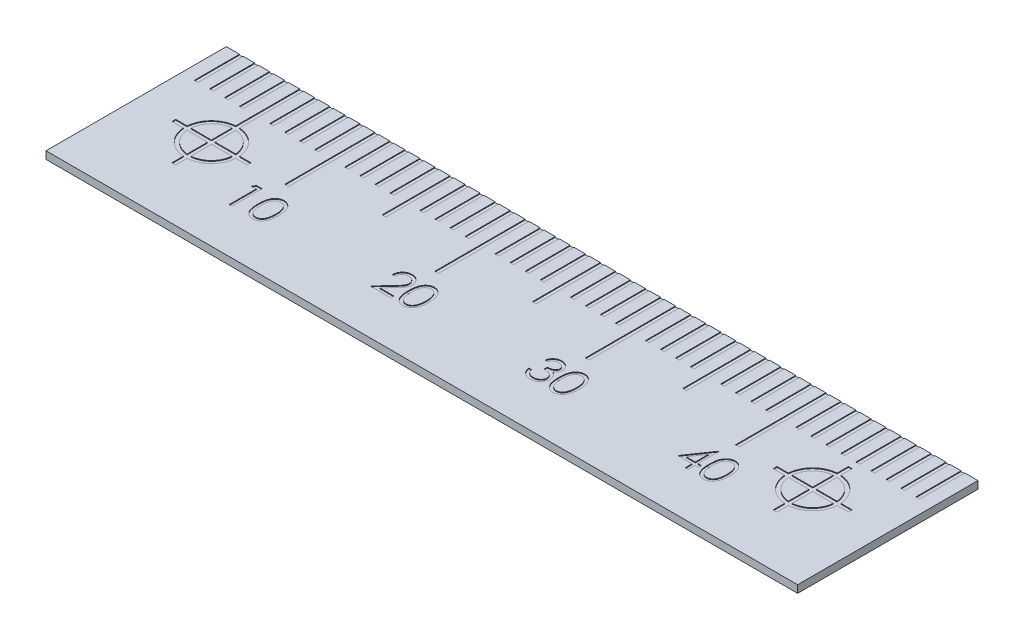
from build123d import *

# Parameters (mm, degrees)
SKETCH1_W           = 50
SKETCH1_H           = 12
BOSS_EXTRUDE1_DEPTH = 0.5
SKETCH2_W           = 0.25
SKETCH2_H           = 3
CUT_EXTRUDE2_DEPTH  = 0.05
LPATTERN2_COUNT     = 49
LPATTERN2_PITCH     = 1
SKETCH3_W           = 0.25
SKETCH3_H           = 3
CUT_EXTRUDE3_DEPTH  = 0.05
LPATTERN3_COUNT     = 4
LPATTERN3_PITCH     = 10
SKETCH4_W           = 0.25
SKETCH4_H           = 1.5
CUT_EXTRUDE4_DEPTH  = 0.05
LPATTERN4_COUNT     = 3
LPATTERN4_PITCH     = 10
LPATTERN4_COL_COUNT = 2
LPATTERN4_COL_PITCH = 10
CUT_EXTRUDE6_DEPTH  = 0.05
LPATTERN5_COUNT     = 2
LPATTERN5_PITCH     = 40
CUT_EXTRUDE7_DEPTH  = 0.05


with BuildPart() as part:
    # Sketch1 → Boss-Extrude1 (new body)
    with BuildSketch(Plane(origin=(0, 0, 0), x_dir=(1, 0, 0), z_dir=(0, 1, 0))):
        Rectangle(SKETCH1_W, SKETCH1_H)
    extrude(amount=-BOSS_EXTRUDE1_DEPTH)

    # Sketch2 → Cut-Extrude2 (cut)
    with BuildSketch(Plane(origin=(0, 0, 0), x_dir=(1, 0, 0), z_dir=(0, 1, 0))):
        with Locations((-24, 4.5)):
            Rectangle(SKETCH2_W, SKETCH2_H)
    cut_extrude2 = extrude(amount=-CUT_EXTRUDE2_DEPTH, mode=Mode.SUBTRACT)

    # LPattern2: Cut-Extrude2 ×49
    with Locations(*[(i * LPATTERN2_PITCH, 0, 0) for i in range(1, LPATTERN2_COUNT)]):
        add(cut_extrude2, mode=Mode.SUBTRACT)

    # Sketch3 → Cut-Extrude3 (cut)
    with BuildSketch(Plane(origin=(0, 0, 0), x_dir=(1, 0, 0), z_dir=(0, 1, 0))):
        with Locations((-15, 1.5)):
            Rectangle(SKETCH3_W, SKETCH3_H)
    cut_extrude3 = extrude(amount=-CUT_EXTRUDE3_DEPTH, mode=Mode.SUBTRACT)

    # LPattern3: Cut-Extrude3 ×4
    with Locations(*[(i * LPATTERN3_PITCH, 0, 0) for i in range(1, LPATTERN3_COUNT)]):
        add(cut_extrude3, mode=Mode.SUBTRACT)

    # Sketch4 → Cut-Extrude4 (cut)
    with BuildSketch(Plane(origin=(0, 0, 0), x_dir=(1, 0, 0), z_dir=(0, 1, 0))):
        with Locations((-10, 2.25)):
            Rectangle(SKETCH4_W, SKETCH4_H)
    cut_extrude4 = extrude(amount=-CUT_EXTRUDE4_DEPTH, mode=Mode.SUBTRACT)

    # LPattern4: Cut-Extrude4 ×3
    with Locations(*[(i * LPATTERN4_PITCH, 0, 0) for i in range(1, LPATTERN4_COUNT)]):
        add(cut_extrude4, mode=Mode.SUBTRACT)

    # LPattern4 col: Cut-Extrude4 ×2
    with Locations(*[(-i * LPATTERN4_COL_PITCH, 0, 0) for i in range(1, LPATTERN4_COL_COUNT)]):
        add(cut_extrude4, mode=Mode.SUBTRACT)

    # Sketch5 → Cut-Extrude6 (cut)
    with BuildSketch(Plane(origin=(0, 0, 0), x_dir=(1, 0, 0), z_dir=(0, 1, 0))):
        with BuildLine():
            Line((-20.12, 2.5), (-19.87, 2.5))
            Line((-19.87, 2.5), (-19.87, 1.745530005))
            ThreePointArc((-19.87, 1.745530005), (-18.757563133, 1.237436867), (-18.249469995, 0.125))
            Line((-18.249469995, 0.125), (-17.495, 0.125))
            Line((-17.495, 0.125), (-17.495, -0.125))
            Line((-17.495, -0.125), (-18.249469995, -0.125))
            ThreePointArc((-18.249469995, -0.125), (-18.757563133, -1.237436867), (-19.87, -1.745530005))
            Line((-19.87, -1.745530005), (-19.87, -2.5))
            Line((-19.87, -2.5), (-20.12, -2.5))
            Line((-20.12, -2.5), (-20.12, -1.745530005))
            ThreePointArc((-20.12, -1.745530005), (-21.232436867, -1.237436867), (-21.740530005, -0.125))
            Line((-21.740530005, -0.125), (-22.495, -0.125))
            Line((-22.495, -0.125), (-22.495, 0.125))
            Line((-22.495, 0.125), (-21.740530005, 0.125))
            ThreePointArc((-21.740530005, 0.125), (-21.232436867, 1.237436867), (-20.12, 1.745530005))
            Line((-20.12, 1.745530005), (-20.12, 2.5))
        make_face()
        with BuildLine():
            Line((-20.12, 1.494782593), (-20.12, 0.125))
            Line((-20.12, 0.125), (-21.489782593, 0.125))
            ThreePointArc((-21.489782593, 0.125), (-21.055660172, 1.060660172), (-20.12, 1.494782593))
        make_face(mode=Mode.SUBTRACT)
        with BuildLine():
            Line((-19.87, 1.494782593), (-19.87, 0.125))
            Line((-19.87, 0.125), (-18.500217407, 0.125))
            ThreePointArc((-18.500217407, 0.125), (-18.934339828, 1.060660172), (-19.87, 1.494782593))
        make_face(mode=Mode.SUBTRACT)
        with BuildLine():
            Line((-21.489782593, -0.125), (-20.12, -0.125))
            Line((-20.12, -0.125), (-20.12, -1.494782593))
            ThreePointArc((-20.12, -1.494782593), (-21.055660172, -1.060660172), (-21.489782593, -0.125))
        make_face(mode=Mode.SUBTRACT)
        with BuildLine():
            Line((-19.87, -0.125), (-19.87, -1.494782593))
            ThreePointArc((-19.87, -1.494782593), (-18.934339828, -1.060660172), (-18.500217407, -0.125))
            Line((-18.500217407, -0.125), (-19.87, -0.125))
        make_face(mode=Mode.SUBTRACT)
    cut_extrude6 = extrude(amount=-CUT_EXTRUDE6_DEPTH, mode=Mode.SUBTRACT)

    # LPattern5: Cut-Extrude6 ×2
    with Locations(*[(i * LPATTERN5_PITCH, 0, 0) for i in range(1, LPATTERN5_COUNT)]):
        add(cut_extrude6, mode=Mode.SUBTRACT)

    # Sketch7 → Cut-Extrude7 (cut)
    # profile 1 of 8: a face of its own
    with BuildSketch(Plane(origin=(0, 0, 0), x_dir=(1, 0, 0), z_dir=(0, 1, 0))):
        Polygon((-15.997996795, -1), (-15.628205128, -1), (-15.628205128, -3), (-15.807692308, -3), (-15.807692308, -1.205128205), (-16.115384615, -1.205128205), align=None)
    # profile 2 of 8: a face of its own
    with BuildSketch(Plane(origin=(0, 0, 0), x_dir=(1, 0, 0), z_dir=(0, 1, 0))):
        with BuildLine():
            add(Edge.make_bspline(
                [(-14.884615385, -2.000801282), (-14.884427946, -1.968745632), (-14.884063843, -1.906477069), (-14.880013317, -1.815742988), (-14.87328455, -1.730622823), (-14.864063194, -1.6511125), (-14.852841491, -1.577191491), (-14.837861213, -1.509057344), (-14.820825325, -1.446394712), (-14.801081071, -1.388999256), (-14.778802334, -1.336097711), (-14.754554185, -1.286711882), (-14.727374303, -1.240916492), (-14.698816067, -1.197980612), (-14.667723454, -1.158607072), (-14.634981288, -1.122239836), (-14.599311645, -1.089719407), (-14.561927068, -1.060092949), (-14.522489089, -1.034121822), (-14.482121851, -1.011245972), (-14.440547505, -0.99170319), (-14.397652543, -0.976337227), (-14.35382251, -0.963645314), (-14.308904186, -0.954965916), (-14.262823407, -0.949504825), (-14.23171973, -0.948982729), (-14.215945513, -0.948717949)],
                knots=[0, 0, 0, 0, 1.646270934, 3.197905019, 4.663502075, 6.030701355, 7.308322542, 8.50163776, 9.611534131, 10.641858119, 11.616356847, 12.558055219, 13.465016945, 14.349605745, 15.204443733, 16.039544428, 16.859896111, 17.680448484, 18.487036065, 19.28249412, 20.06191084, 20.843045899, 21.620316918, 22.403196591, 23.190181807, 24, 24, 24, 24], degree=3))
            add(Edge.make_bspline(
                [(-14.215945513, -0.948717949), (-14.200039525, -0.9489967), (-14.16840752, -0.949551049), (-14.121641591, -0.954879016), (-14.075956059, -0.963719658), (-14.031545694, -0.976245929), (-13.988045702, -0.991786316), (-13.945796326, -1.011264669), (-13.904535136, -1.033938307), (-13.864917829, -1.060580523), (-13.826509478, -1.090284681), (-13.790253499, -1.123863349), (-13.756146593, -1.160977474), (-13.723760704, -1.201229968), (-13.694014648, -1.245392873), (-13.665686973, -1.292698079), (-13.640331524, -1.343972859), (-13.615911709, -1.398361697), (-13.594833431, -1.457369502), (-13.575824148, -1.520663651), (-13.560464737, -1.588991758), (-13.547670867, -1.661995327), (-13.537759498, -1.73994246), (-13.530540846, -1.822666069), (-13.526727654, -1.910220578), (-13.526009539, -1.970082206), (-13.525641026, -2.000801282)],
                knots=[0, 0, 0, 0, 0.810914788, 1.612654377, 2.396697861, 3.181598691, 3.963628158, 4.749916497, 5.551656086, 6.361998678, 7.18212741, 8.025565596, 8.878627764, 9.750805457, 10.657531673, 11.591944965, 12.560506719, 13.57287815, 14.630710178, 15.753379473, 16.941251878, 18.199788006, 19.531962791, 20.947069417, 22.433333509, 24, 24, 24, 24], degree=3))
            add(Edge.make_bspline(
                [(-13.525641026, -2.000801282), (-13.52601336, -2.031386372), (-13.526738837, -2.090980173), (-13.530498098, -2.178140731), (-13.53790303, -2.260425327), (-13.547165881, -2.338031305), (-13.559995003, -2.410635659), (-13.575769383, -2.47848963), (-13.593283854, -2.541886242), (-13.614903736, -2.600306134), (-13.638566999, -2.654564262), (-13.664312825, -2.705231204), (-13.691895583, -2.752754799), (-13.721946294, -2.796754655), (-13.753976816, -2.837542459), (-13.788672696, -2.874398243), (-13.825055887, -2.908210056), (-13.863577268, -2.9382967), (-13.90381244, -2.964630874), (-13.944931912, -2.988181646), (-13.987665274, -3.007171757), (-14.031044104, -3.023477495), (-14.075688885, -3.035934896), (-14.121543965, -3.044548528), (-14.1683761, -3.050589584), (-14.200034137, -3.05105043), (-14.215945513, -3.051282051)],
                knots=[0, 0, 0, 0, 1.561518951, 3.042555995, 4.452378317, 5.7783523, 7.031515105, 8.214008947, 9.334062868, 10.386615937, 11.391082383, 12.354592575, 13.286541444, 14.194233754, 15.072674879, 15.931287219, 16.775624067, 17.606195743, 18.42308326, 19.229000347, 20.022332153, 20.807536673, 21.593273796, 22.3848459, 23.188221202, 24, 24, 24, 24], degree=3))
            add(Edge.make_bspline(
                [(-14.215945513, -3.051282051), (-14.231719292, -3.051015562), (-14.262822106, -3.050490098), (-14.308909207, -3.04505368), (-14.353642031, -3.036313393), (-14.397241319, -3.024075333), (-14.439930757, -3.009095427), (-14.481128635, -2.989579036), (-14.521293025, -2.967102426), (-14.560316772, -2.941505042), (-14.597466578, -2.912178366), (-14.632951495, -2.879741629), (-14.665880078, -2.843385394), (-14.696528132, -2.803683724), (-14.725656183, -2.761001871), (-14.75245011, -2.714757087), (-14.777233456, -2.665132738), (-14.799886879, -2.611808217), (-14.819971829, -2.554005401), (-14.837713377, -2.491063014), (-14.851721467, -2.422425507), (-14.863711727, -2.348644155), (-14.873382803, -2.269401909), (-14.879985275, -2.18465575), (-14.884066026, -2.094458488), (-14.884428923, -2.032590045), (-14.884615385, -2.000801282)],
                knots=[0, 0, 0, 0, 0.810891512, 1.598919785, 2.382837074, 3.152667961, 3.926044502, 4.706494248, 5.493654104, 6.291793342, 7.103789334, 7.925228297, 8.761435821, 9.622817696, 10.50288917, 11.416980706, 12.369136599, 13.353924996, 14.394355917, 15.514179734, 16.714354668, 17.994756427, 19.357759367, 20.818452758, 22.365282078, 24, 24, 24, 24], degree=3))
        make_face()
        with BuildLine():
            add(Edge.make_bspline(
                [(-14.705128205, -2), (-14.70505995, -2.026713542), (-14.704927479, -2.078559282), (-14.701466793, -2.153898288), (-14.696752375, -2.224167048), (-14.690671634, -2.289454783), (-14.681641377, -2.349540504), (-14.671523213, -2.404837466), (-14.659210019, -2.45505303), (-14.644641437, -2.500531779), (-14.628047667, -2.542045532), (-14.609930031, -2.580674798), (-14.590466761, -2.616875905), (-14.568684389, -2.650323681), (-14.544961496, -2.681127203), (-14.519833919, -2.709831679), (-14.492363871, -2.735429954), (-14.454361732, -2.766131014), (-14.404192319, -2.797856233), (-14.34098063, -2.82548257), (-14.276027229, -2.842843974), (-14.231940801, -2.845051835), (-14.209935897, -2.846153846)],
                knots=[0, 0, 0, 0, 1.459021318, 2.831673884, 4.118529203, 5.306027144, 6.411944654, 7.436330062, 8.375795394, 9.233974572, 10.042671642, 10.816086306, 11.563610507, 12.285937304, 12.993564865, 13.685989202, 14.367179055, 15.041617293, 16.353048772, 17.594441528, 18.799311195, 20, 20, 20, 20], degree=3))
            add(Edge.make_bspline(
                [(-14.209935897, -2.846153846), (-14.187788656, -2.845240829), (-14.1435399, -2.843416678), (-14.078892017, -2.8258174), (-14.016131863, -2.799263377), (-13.966947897, -2.767864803), (-13.929529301, -2.7379629), (-13.902719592, -2.712468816), (-13.878112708, -2.683922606), (-13.854774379, -2.653123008), (-13.833369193, -2.619481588), (-13.813904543, -2.583160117), (-13.79614263, -2.544057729), (-13.786023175, -2.516760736), (-13.780849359, -2.502804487)],
                knots=[0, 0, 0, 0, 1.353760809, 2.704726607, 4.075137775, 5.516104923, 6.260822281, 7.007110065, 7.778089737, 8.566572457, 9.372053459, 10.217411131, 11.088608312, 12, 12, 12, 12], degree=3))
            add(Edge.make_bspline(
                [(-13.780849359, -2.502804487), (-13.774819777, -2.484958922), (-13.762577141, -2.448724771), (-13.746798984, -2.39251697), (-13.734373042, -2.333543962), (-13.723193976, -2.272158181), (-13.715563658, -2.207906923), (-13.70942205, -2.140988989), (-13.705804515, -2.071353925), (-13.705356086, -2.024042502), (-13.705128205, -2)],
                knots=[0, 0, 0, 0, 0.884706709, 1.796334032, 2.740027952, 3.714592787, 4.726048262, 5.777819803, 6.87074269, 8, 8, 8, 8], degree=3))
            add(Edge.make_bspline(
                [(-13.705128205, -2), (-13.705442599, -1.975961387), (-13.706057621, -1.928936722), (-13.708408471, -1.86006919), (-13.714479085, -1.794659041), (-13.721221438, -1.732424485), (-13.731162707, -1.673710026), (-13.741881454, -1.618024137), (-13.756282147, -1.566056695), (-13.771664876, -1.516994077), (-13.789270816, -1.471393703), (-13.808651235, -1.429042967), (-13.829349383, -1.38973741), (-13.851830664, -1.353584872), (-13.875828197, -1.320423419), (-13.901975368, -1.290917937), (-13.929235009, -1.264153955), (-13.967416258, -1.233603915), (-14.017401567, -1.202454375), (-14.07959908, -1.173788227), (-14.144325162, -1.157326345), (-14.188081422, -1.155005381), (-14.209935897, -1.153846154)],
                knots=[0, 0, 0, 0, 1.31362396, 2.569729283, 3.763502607, 4.902122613, 5.988968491, 7.01645872, 7.998833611, 8.933434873, 9.825090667, 10.667526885, 11.477055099, 12.250526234, 12.991942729, 13.710640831, 14.402115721, 15.076753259, 16.378508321, 17.609869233, 18.806226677, 20, 20, 20, 20], degree=3))
            add(Edge.make_bspline(
                [(-14.209935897, -1.153846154), (-14.232056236, -1.155006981), (-14.27633721, -1.157330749), (-14.341736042, -1.173726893), (-14.404424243, -1.202305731), (-14.454277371, -1.233707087), (-14.492485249, -1.263614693), (-14.519389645, -1.28954981), (-14.544616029, -1.317919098), (-14.567854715, -1.349005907), (-14.58962002, -1.382414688), (-14.60960917, -1.418408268), (-14.627619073, -1.457169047), (-14.644238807, -1.498664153), (-14.658851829, -1.544138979), (-14.670905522, -1.594292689), (-14.682040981, -1.64941377), (-14.689923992, -1.709824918), (-14.696931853, -1.775129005), (-14.70143548, -1.845573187), (-14.704939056, -1.921038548), (-14.705063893, -1.973152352), (-14.705128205, -2)],
                knots=[0, 0, 0, 0, 1.207732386, 2.417664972, 3.655092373, 4.956220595, 5.625982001, 6.301752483, 6.994047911, 7.697131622, 8.419323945, 9.170223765, 9.943494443, 10.752040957, 11.610060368, 12.549350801, 13.567764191, 14.679664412, 15.874934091, 17.154273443, 18.533957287, 20, 20, 20, 20], degree=3))
        make_face(mode=Mode.SUBTRACT)
    # profile 3 of 8: a face of its own
    with BuildSketch(Plane(origin=(0, 0, 0), x_dir=(1, 0, 0), z_dir=(0, 1, 0))):
        with BuildLine():
            Line((-6.166666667, -1.615384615), (-6.346153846, -1.615384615))
            add(Edge.make_bspline(
                [(-6.346153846, -1.615384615), (-6.344984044, -1.59157268), (-6.342686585, -1.544806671), (-6.331927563, -1.476621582), (-6.316532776, -1.411447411), (-6.29476623, -1.34980746), (-6.267734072, -1.291156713), (-6.235316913, -1.235728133), (-6.196920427, -1.183733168), (-6.153373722, -1.135653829), (-6.106077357, -1.091546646), (-6.055045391, -1.053457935), (-6.001419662, -1.021276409), (-5.945362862, -0.994372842), (-5.88624254, -0.974178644), (-5.824595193, -0.95919485), (-5.760149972, -0.950179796), (-5.716241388, -0.949210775), (-5.693910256, -0.948717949)],
                knots=[0, 0, 0, 0, 1.10065271, 2.161652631, 3.183658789, 4.190468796, 5.17591951, 6.163126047, 7.15150782, 8.156236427, 9.156009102, 10.134482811, 11.092018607, 12.041330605, 13.001268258, 13.972401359, 14.968799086, 16, 16, 16, 16], degree=3))
            add(Edge.make_bspline(
                [(-5.693910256, -0.948717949), (-5.671979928, -0.949231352), (-5.628887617, -0.950240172), (-5.565995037, -0.958903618), (-5.506122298, -0.972472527), (-5.449386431, -0.991509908), (-5.396240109, -1.017101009), (-5.346284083, -1.04784246), (-5.29892362, -1.083396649), (-5.256291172, -1.125255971), (-5.217143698, -1.169943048), (-5.183370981, -1.217650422), (-5.154449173, -1.266924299), (-5.130341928, -1.318140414), (-5.112595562, -1.371781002), (-5.099122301, -1.427065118), (-5.091506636, -1.48456501), (-5.090337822, -1.523483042), (-5.08974359, -1.543269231)],
                knots=[0, 0, 0, 0, 1.111607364, 2.184268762, 3.212621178, 4.221274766, 5.211760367, 6.196651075, 7.1921475, 8.207485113, 9.220403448, 10.201281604, 11.166441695, 12.114753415, 13.065576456, 14.026450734, 14.996634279, 16, 16, 16, 16], degree=3))
            add(Edge.make_bspline(
                [(-5.08974359, -1.543269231), (-5.090711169, -1.571125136), (-5.092629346, -1.626348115), (-5.109037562, -1.707499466), (-5.134664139, -1.786124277), (-5.165519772, -1.849402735), (-5.196646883, -1.900393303), (-5.224696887, -1.94237542), (-5.257533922, -1.987578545), (-5.295635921, -2.035851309), (-5.338214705, -2.087571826), (-5.385655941, -2.142708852), (-5.438297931, -2.20069272), (-5.475245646, -2.240295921), (-5.494391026, -2.260817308)],
                knots=[0, 0, 0, 0, 1.184426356, 2.348067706, 3.509069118, 4.696110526, 5.333549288, 6.050745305, 6.844228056, 7.710549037, 8.667450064, 9.695053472, 10.805634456, 12, 12, 12, 12], degree=3))
            Line((-5.494391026, -2.260817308), (-5.994791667, -2.794871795))
            Line((-5.994791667, -2.794871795), (-5.064102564, -2.794871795))
            Line((-5.064102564, -2.794871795), (-5.064102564, -3))
            Line((-5.064102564, -3), (-6.423076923, -3))
            Line((-6.423076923, -3), (-5.647435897, -2.172275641))
            add(Edge.make_bspline(
                [(-5.647435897, -2.172275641), (-5.628551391, -2.152562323), (-5.592278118, -2.114697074), (-5.540973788, -2.059415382), (-5.494894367, -2.00812993), (-5.453741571, -1.960937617), (-5.418408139, -1.917148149), (-5.387052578, -1.878179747), (-5.361929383, -1.842320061), (-5.334663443, -1.800753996), (-5.308255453, -1.750004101), (-5.285562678, -1.68798485), (-5.271725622, -1.624140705), (-5.270065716, -1.580996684), (-5.269230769, -1.559294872)],
                knots=[0, 0, 0, 0, 1.329631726, 2.553950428, 3.673215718, 4.687767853, 5.603093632, 6.413772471, 7.123043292, 7.734684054, 8.834405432, 9.900288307, 10.943827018, 12, 12, 12, 12], degree=3))
            add(Edge.make_bspline(
                [(-5.269230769, -1.559294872), (-5.269594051, -1.545648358), (-5.270310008, -1.518753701), (-5.276628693, -1.479321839), (-5.286177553, -1.441284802), (-5.299860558, -1.404525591), (-5.317921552, -1.36941379), (-5.339906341, -1.335906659), (-5.365272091, -1.303512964), (-5.394615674, -1.273139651), (-5.426850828, -1.245321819), (-5.460904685, -1.220679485), (-5.496933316, -1.200085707), (-5.534784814, -1.183203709), (-5.574353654, -1.169960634), (-5.615716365, -1.160784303), (-5.65875866, -1.155022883), (-5.688149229, -1.154243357), (-5.703125, -1.153846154)],
                knots=[0, 0, 0, 0, 0.991446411, 1.95395049, 2.89581595, 3.838931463, 4.798493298, 5.75982156, 6.748411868, 7.785213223, 8.824556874, 9.840280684, 10.836137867, 11.835679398, 12.848801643, 13.863922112, 14.911575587, 16, 16, 16, 16], degree=3))
            add(Edge.make_bspline(
                [(-5.703125, -1.153846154), (-5.718765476, -1.154254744), (-5.749480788, -1.155057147), (-5.794577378, -1.160670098), (-5.837597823, -1.170353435), (-5.878650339, -1.183597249), (-5.917804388, -1.200430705), (-5.954869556, -1.221397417), (-5.989762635, -1.246416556), (-6.02254922, -1.274782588), (-6.052757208, -1.306364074), (-6.07929828, -1.341569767), (-6.102489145, -1.379756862), (-6.122722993, -1.420822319), (-6.139154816, -1.465138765), (-6.151710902, -1.512548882), (-6.161646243, -1.562846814), (-6.164965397, -1.597581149), (-6.166666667, -1.615384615)],
                knots=[0, 0, 0, 0, 1.031018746, 2.02475058, 2.990194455, 3.934040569, 4.864654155, 5.795059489, 6.735614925, 7.690564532, 8.649604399, 9.611025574, 10.590972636, 11.591080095, 12.624614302, 13.701020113, 14.821632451, 16, 16, 16, 16], degree=3))
        make_face()
    # profile 4 of 8: a face of its own
    with BuildSketch(Plane(origin=(0, 0, 0), x_dir=(1, 0, 0), z_dir=(0, 1, 0))):
        with BuildLine():
            add(Edge.make_bspline(
                [(-4.884615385, -2.000801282), (-4.884427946, -1.968745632), (-4.884063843, -1.906477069), (-4.880013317, -1.815742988), (-4.87328455, -1.730622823), (-4.864063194, -1.6511125), (-4.852841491, -1.577191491), (-4.837861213, -1.509057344), (-4.820825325, -1.446394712), (-4.801081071, -1.388999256), (-4.778802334, -1.336097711), (-4.754554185, -1.286711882), (-4.727374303, -1.240916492), (-4.698816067, -1.197980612), (-4.667723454, -1.158607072), (-4.634981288, -1.122239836), (-4.599311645, -1.089719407), (-4.561927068, -1.060092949), (-4.522489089, -1.034121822), (-4.482121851, -1.011245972), (-4.440547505, -0.99170319), (-4.397652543, -0.976337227), (-4.35382251, -0.963645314), (-4.308904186, -0.954965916), (-4.262823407, -0.949504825), (-4.23171973, -0.948982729), (-4.215945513, -0.948717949)],
                knots=[0, 0, 0, 0, 1.646270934, 3.197905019, 4.663502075, 6.030701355, 7.308322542, 8.50163776, 9.611534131, 10.641858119, 11.616356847, 12.558055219, 13.465016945, 14.349605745, 15.204443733, 16.039544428, 16.859896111, 17.680448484, 18.487036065, 19.28249412, 20.06191084, 20.843045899, 21.620316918, 22.403196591, 23.190181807, 24, 24, 24, 24], degree=3))
            add(Edge.make_bspline(
                [(-4.215945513, -0.948717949), (-4.200039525, -0.9489967), (-4.16840752, -0.949551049), (-4.121641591, -0.954879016), (-4.075956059, -0.963719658), (-4.031545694, -0.976245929), (-3.988045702, -0.991786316), (-3.945796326, -1.011264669), (-3.904535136, -1.033938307), (-3.864917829, -1.060580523), (-3.826509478, -1.090284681), (-3.790253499, -1.123863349), (-3.756146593, -1.160977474), (-3.723760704, -1.201229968), (-3.694014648, -1.245392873), (-3.665686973, -1.292698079), (-3.640331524, -1.343972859), (-3.615911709, -1.398361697), (-3.594833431, -1.457369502), (-3.575824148, -1.520663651), (-3.560464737, -1.588991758), (-3.547670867, -1.661995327), (-3.537759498, -1.73994246), (-3.530540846, -1.822666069), (-3.526727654, -1.910220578), (-3.526009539, -1.970082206), (-3.525641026, -2.000801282)],
                knots=[0, 0, 0, 0, 0.810914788, 1.612654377, 2.396697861, 3.181598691, 3.963628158, 4.749916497, 5.551656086, 6.361998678, 7.18212741, 8.025565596, 8.878627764, 9.750805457, 10.657531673, 11.591944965, 12.560506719, 13.57287815, 14.630710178, 15.753379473, 16.941251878, 18.199788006, 19.531962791, 20.947069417, 22.433333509, 24, 24, 24, 24], degree=3))
            add(Edge.make_bspline(
                [(-3.525641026, -2.000801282), (-3.52601336, -2.031386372), (-3.526738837, -2.090980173), (-3.530498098, -2.178140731), (-3.53790303, -2.260425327), (-3.547165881, -2.338031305), (-3.559995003, -2.410635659), (-3.575769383, -2.47848963), (-3.593283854, -2.541886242), (-3.614903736, -2.600306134), (-3.638566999, -2.654564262), (-3.664312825, -2.705231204), (-3.691895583, -2.752754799), (-3.721946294, -2.796754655), (-3.753976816, -2.837542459), (-3.788672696, -2.874398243), (-3.825055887, -2.908210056), (-3.863577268, -2.9382967), (-3.90381244, -2.964630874), (-3.944931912, -2.988181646), (-3.987665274, -3.007171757), (-4.031044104, -3.023477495), (-4.075688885, -3.035934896), (-4.121543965, -3.044548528), (-4.1683761, -3.050589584), (-4.200034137, -3.05105043), (-4.215945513, -3.051282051)],
                knots=[0, 0, 0, 0, 1.561518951, 3.042555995, 4.452378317, 5.7783523, 7.031515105, 8.214008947, 9.334062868, 10.386615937, 11.391082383, 12.354592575, 13.286541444, 14.194233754, 15.072674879, 15.931287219, 16.775624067, 17.606195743, 18.42308326, 19.229000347, 20.022332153, 20.807536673, 21.593273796, 22.3848459, 23.188221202, 24, 24, 24, 24], degree=3))
            add(Edge.make_bspline(
                [(-4.215945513, -3.051282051), (-4.231719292, -3.051015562), (-4.262822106, -3.050490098), (-4.308909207, -3.04505368), (-4.353642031, -3.036313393), (-4.397241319, -3.024075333), (-4.439930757, -3.009095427), (-4.481128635, -2.989579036), (-4.521293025, -2.967102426), (-4.560316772, -2.941505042), (-4.597466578, -2.912178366), (-4.632951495, -2.879741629), (-4.665880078, -2.843385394), (-4.696528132, -2.803683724), (-4.725656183, -2.761001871), (-4.75245011, -2.714757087), (-4.777233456, -2.665132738), (-4.799886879, -2.611808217), (-4.819971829, -2.554005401), (-4.837713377, -2.491063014), (-4.851721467, -2.422425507), (-4.863711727, -2.348644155), (-4.873382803, -2.269401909), (-4.879985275, -2.18465575), (-4.884066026, -2.094458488), (-4.884428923, -2.032590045), (-4.884615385, -2.000801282)],
                knots=[0, 0, 0, 0, 0.810891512, 1.598919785, 2.382837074, 3.152667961, 3.926044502, 4.706494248, 5.493654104, 6.291793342, 7.103789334, 7.925228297, 8.761435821, 9.622817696, 10.50288917, 11.416980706, 12.369136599, 13.353924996, 14.394355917, 15.514179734, 16.714354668, 17.994756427, 19.357759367, 20.818452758, 22.365282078, 24, 24, 24, 24], degree=3))
        make_face()
        with BuildLine():
            add(Edge.make_bspline(
                [(-4.705128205, -2), (-4.70505995, -2.026713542), (-4.704927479, -2.078559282), (-4.701466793, -2.153898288), (-4.696752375, -2.224167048), (-4.690671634, -2.289454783), (-4.681641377, -2.349540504), (-4.671523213, -2.404837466), (-4.659210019, -2.45505303), (-4.644641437, -2.500531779), (-4.628047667, -2.542045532), (-4.609930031, -2.580674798), (-4.590466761, -2.616875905), (-4.568684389, -2.650323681), (-4.544961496, -2.681127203), (-4.519833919, -2.709831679), (-4.492363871, -2.735429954), (-4.454361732, -2.766131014), (-4.404192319, -2.797856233), (-4.34098063, -2.82548257), (-4.276027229, -2.842843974), (-4.231940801, -2.845051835), (-4.209935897, -2.846153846)],
                knots=[0, 0, 0, 0, 1.459021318, 2.831673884, 4.118529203, 5.306027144, 6.411944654, 7.436330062, 8.375795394, 9.233974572, 10.042671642, 10.816086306, 11.563610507, 12.285937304, 12.993564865, 13.685989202, 14.367179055, 15.041617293, 16.353048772, 17.594441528, 18.799311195, 20, 20, 20, 20], degree=3))
            add(Edge.make_bspline(
                [(-4.209935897, -2.846153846), (-4.187788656, -2.845240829), (-4.1435399, -2.843416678), (-4.078892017, -2.8258174), (-4.016131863, -2.799263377), (-3.966947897, -2.767864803), (-3.929529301, -2.7379629), (-3.902719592, -2.712468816), (-3.878112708, -2.683922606), (-3.854774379, -2.653123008), (-3.833369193, -2.619481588), (-3.813904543, -2.583160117), (-3.79614263, -2.544057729), (-3.786023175, -2.516760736), (-3.780849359, -2.502804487)],
                knots=[0, 0, 0, 0, 1.353760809, 2.704726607, 4.075137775, 5.516104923, 6.260822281, 7.007110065, 7.778089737, 8.566572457, 9.372053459, 10.217411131, 11.088608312, 12, 12, 12, 12], degree=3))
            add(Edge.make_bspline(
                [(-3.780849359, -2.502804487), (-3.774819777, -2.484958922), (-3.762577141, -2.448724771), (-3.746798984, -2.39251697), (-3.734373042, -2.333543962), (-3.723193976, -2.272158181), (-3.715563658, -2.207906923), (-3.70942205, -2.140988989), (-3.705804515, -2.071353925), (-3.705356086, -2.024042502), (-3.705128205, -2)],
                knots=[0, 0, 0, 0, 0.884706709, 1.796334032, 2.740027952, 3.714592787, 4.726048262, 5.777819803, 6.87074269, 8, 8, 8, 8], degree=3))
            add(Edge.make_bspline(
                [(-3.705128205, -2), (-3.705442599, -1.975961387), (-3.706057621, -1.928936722), (-3.708408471, -1.86006919), (-3.714479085, -1.794659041), (-3.721221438, -1.732424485), (-3.731162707, -1.673710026), (-3.741881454, -1.618024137), (-3.756282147, -1.566056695), (-3.771664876, -1.516994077), (-3.789270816, -1.471393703), (-3.808651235, -1.429042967), (-3.829349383, -1.38973741), (-3.851830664, -1.353584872), (-3.875828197, -1.320423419), (-3.901975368, -1.290917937), (-3.929235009, -1.264153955), (-3.967416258, -1.233603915), (-4.017401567, -1.202454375), (-4.07959908, -1.173788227), (-4.144325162, -1.157326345), (-4.188081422, -1.155005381), (-4.209935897, -1.153846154)],
                knots=[0, 0, 0, 0, 1.31362396, 2.569729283, 3.763502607, 4.902122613, 5.988968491, 7.01645872, 7.998833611, 8.933434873, 9.825090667, 10.667526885, 11.477055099, 12.250526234, 12.991942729, 13.710640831, 14.402115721, 15.076753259, 16.378508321, 17.609869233, 18.806226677, 20, 20, 20, 20], degree=3))
            add(Edge.make_bspline(
                [(-4.209935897, -1.153846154), (-4.232056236, -1.155006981), (-4.27633721, -1.157330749), (-4.341736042, -1.173726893), (-4.404424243, -1.202305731), (-4.454277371, -1.233707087), (-4.492485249, -1.263614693), (-4.519389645, -1.28954981), (-4.544616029, -1.317919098), (-4.567854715, -1.349005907), (-4.58962002, -1.382414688), (-4.60960917, -1.418408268), (-4.627619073, -1.457169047), (-4.644238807, -1.498664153), (-4.658851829, -1.544138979), (-4.670905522, -1.594292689), (-4.682040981, -1.64941377), (-4.689923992, -1.709824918), (-4.696931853, -1.775129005), (-4.70143548, -1.845573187), (-4.704939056, -1.921038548), (-4.705063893, -1.973152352), (-4.705128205, -2)],
                knots=[0, 0, 0, 0, 1.207732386, 2.417664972, 3.655092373, 4.956220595, 5.625982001, 6.301752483, 6.994047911, 7.697131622, 8.419323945, 9.170223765, 9.943494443, 10.752040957, 11.610060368, 12.549350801, 13.567764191, 14.679664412, 15.874934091, 17.154273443, 18.533957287, 20, 20, 20, 20], degree=3))
        make_face(mode=Mode.SUBTRACT)
    # profile 5 of 8: a face of its own
    with BuildSketch(Plane(origin=(0, 0, 0), x_dir=(1, 0, 0), z_dir=(0, 1, 0))):
        with BuildLine():
            Line((3.833333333, -1.461538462), (3.653846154, -1.461538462))
            add(Edge.make_bspline(
                [(3.653846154, -1.461538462), (3.658708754, -1.441405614), (3.66821474, -1.402047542), (3.688041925, -1.345814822), (3.7096415, -1.292601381), (3.735578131, -1.243403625), (3.763868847, -1.197232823), (3.796281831, -1.155136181), (3.831321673, -1.116043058), (3.870078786, -1.081349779), (3.910723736, -1.049933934), (3.953829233, -1.023148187), (3.998528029, -1.000105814), (4.04512982, -0.981122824), (4.093773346, -0.966822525), (4.144018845, -0.956447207), (4.195997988, -0.949709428), (4.231282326, -0.949051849), (4.249198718, -0.948717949)],
                knots=[0, 0, 0, 0, 1.162005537, 2.271625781, 3.343758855, 4.383309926, 5.390229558, 6.379919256, 7.361854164, 8.333198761, 9.295911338, 10.242430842, 11.177959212, 12.116337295, 13.062827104, 14.020064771, 14.994644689, 16, 16, 16, 16], degree=3))
            add(Edge.make_bspline(
                [(4.249198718, -0.948717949), (4.275303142, -0.94950608), (4.326942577, -0.951065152), (4.402807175, -0.965301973), (4.475965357, -0.98783062), (4.545616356, -1.018958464), (4.610312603, -1.057351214), (4.667876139, -1.10304535), (4.717526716, -1.155159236), (4.759180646, -1.212720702), (4.791794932, -1.274238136), (4.815844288, -1.337552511), (4.830485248, -1.402513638), (4.832382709, -1.44637494), (4.833333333, -1.468349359)],
                knots=[0, 0, 0, 0, 1.083050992, 2.142477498, 3.193116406, 4.255571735, 5.30263384, 6.308962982, 7.297363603, 8.282367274, 9.249857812, 10.179914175, 11.08814088, 12, 12, 12, 12], degree=3))
            add(Edge.make_bspline(
                [(4.833333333, -1.468349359), (4.832668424, -1.489496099), (4.8313673, -1.530876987), (4.820319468, -1.591289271), (4.801727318, -1.648227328), (4.775973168, -1.70193085), (4.742635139, -1.75205933), (4.702250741, -1.798725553), (4.654534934, -1.8421365), (4.618375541, -1.867004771), (4.599759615, -1.879807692)],
                knots=[0, 0, 0, 0, 1.024540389, 2.004866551, 2.965041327, 3.920577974, 4.882998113, 5.874504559, 6.905732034, 8, 8, 8, 8], degree=3))
            add(Edge.make_bspline(
                [(4.599759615, -1.879807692), (4.621034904, -1.890080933), (4.663187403, -1.910435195), (4.720644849, -1.95035277), (4.772803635, -1.996442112), (4.801891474, -2.032409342), (4.81650641, -2.050480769)],
                knots=[0, 0, 0, 0, 1.015518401, 2.012035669, 3.001164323, 4, 4, 4, 4], degree=3))
            add(Edge.make_bspline(
                [(4.81650641, -2.050480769), (4.826130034, -2.063656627), (4.845219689, -2.08979258), (4.868782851, -2.131813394), (4.890159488, -2.17429996), (4.906816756, -2.218391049), (4.919716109, -2.263575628), (4.928936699, -2.309931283), (4.934664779, -2.357495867), (4.935485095, -2.389674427), (4.935897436, -2.405849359)],
                knots=[0, 0, 0, 0, 1.025084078, 2.033381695, 3.024893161, 4.013698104, 4.991890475, 5.976764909, 6.982997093, 8, 8, 8, 8], degree=3))
            add(Edge.make_bspline(
                [(4.935897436, -2.405849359), (4.934872, -2.433854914), (4.932825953, -2.489734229), (4.91453791, -2.572291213), (4.886187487, -2.6529915), (4.845926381, -2.730177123), (4.796859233, -2.802394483), (4.738483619, -2.867009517), (4.671462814, -2.922551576), (4.596716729, -2.968957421), (4.515735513, -3.006053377), (4.429120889, -3.031800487), (4.338120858, -3.048569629), (4.275716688, -3.05036784), (4.243990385, -3.051282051)],
                knots=[0, 0, 0, 0, 0.955779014, 1.907060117, 2.875433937, 3.871313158, 4.872415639, 5.851225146, 6.836215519, 7.83643374, 8.849228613, 9.86973379, 10.916971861, 12, 12, 12, 12], degree=3))
            add(Edge.make_bspline(
                [(4.243990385, -3.051282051), (4.222607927, -3.050785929), (4.180534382, -3.049809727), (4.118680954, -3.043136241), (4.059639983, -3.030947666), (4.003331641, -3.014545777), (3.949705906, -2.993750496), (3.898926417, -2.967854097), (3.850680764, -2.937390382), (3.805424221, -2.90199976), (3.763162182, -2.862410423), (3.725017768, -2.81791956), (3.690355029, -2.769349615), (3.660102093, -2.71613644), (3.632880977, -2.658967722), (3.610491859, -2.597111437), (3.59078582, -2.531120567), (3.58162384, -2.485133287), (3.576923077, -2.461538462)],
                knots=[0, 0, 0, 0, 1.048658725, 2.063410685, 3.046034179, 4.001477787, 4.936774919, 5.862367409, 6.792675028, 7.730719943, 8.675894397, 9.627829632, 10.600096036, 11.597688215, 12.626045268, 13.701542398, 14.82072376, 16, 16, 16, 16], degree=3))
            Line((3.576923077, -2.461538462), (3.756410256, -2.461538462))
            add(Edge.make_bspline(
                [(3.756410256, -2.461538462), (3.761086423, -2.476937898), (3.770181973, -2.506891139), (3.785664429, -2.549999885), (3.803303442, -2.589518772), (3.822226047, -2.625737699), (3.842099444, -2.659013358), (3.864336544, -2.688465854), (3.887290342, -2.715388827), (3.904592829, -2.730557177), (3.913060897, -2.737980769)],
                knots=[0, 0, 0, 0, 1.198163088, 2.33053128, 3.407730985, 4.417276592, 5.372219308, 6.28897303, 7.162600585, 8, 8, 8, 8], degree=3))
            add(Edge.make_bspline(
                [(3.913060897, -2.737980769), (3.924258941, -2.746614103), (3.946620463, -2.763854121), (3.983059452, -2.785855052), (4.021382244, -2.804918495), (4.062419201, -2.819480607), (4.105284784, -2.831810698), (4.15067185, -2.839879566), (4.198179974, -2.845415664), (4.230618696, -2.845904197), (4.247195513, -2.846153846)],
                knots=[0, 0, 0, 0, 0.946170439, 1.889420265, 2.845303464, 3.807233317, 4.801018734, 5.828864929, 6.890507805, 8, 8, 8, 8], degree=3))
            add(Edge.make_bspline(
                [(4.247195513, -2.846153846), (4.2659118, -2.8458019), (4.302509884, -2.845113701), (4.355912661, -2.838784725), (4.406716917, -2.829567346), (4.454358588, -2.815331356), (4.499461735, -2.797742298), (4.541394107, -2.775657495), (4.580706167, -2.749746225), (4.616894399, -2.720295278), (4.649434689, -2.688054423), (4.678085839, -2.654332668), (4.702442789, -2.619272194), (4.722090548, -2.582678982), (4.737605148, -2.544704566), (4.748166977, -2.505242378), (4.7555107, -2.464615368), (4.756108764, -2.436998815), (4.756410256, -2.423076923)],
                knots=[0, 0, 0, 0, 1.217147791, 2.380027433, 3.494444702, 4.572153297, 5.609568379, 6.639424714, 7.649109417, 8.668170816, 9.669597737, 10.625200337, 11.543417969, 12.441394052, 13.322311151, 14.205496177, 15.095365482, 16, 16, 16, 16], degree=3))
            add(Edge.make_bspline(
                [(4.756410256, -2.423076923), (4.755535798, -2.404441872), (4.753791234, -2.367264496), (4.740472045, -2.312568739), (4.718564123, -2.259869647), (4.687894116, -2.210066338), (4.650559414, -2.16390868), (4.606922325, -2.122724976), (4.55662048, -2.088742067), (4.510323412, -2.065262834), (4.469314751, -2.049241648), (4.434220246, -2.03857024), (4.394930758, -2.029533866), (4.351921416, -2.021126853), (4.304868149, -2.013971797), (4.253822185, -2.008005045), (4.198773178, -2.003230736), (4.16066394, -2.001098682), (4.141025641, -2)],
                knots=[0, 0, 0, 0, 1.07054697, 2.135767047, 3.216561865, 4.33974944, 5.486079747, 6.621378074, 7.775625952, 8.963672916, 9.598146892, 10.304877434, 11.070270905, 11.915000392, 12.823868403, 13.805723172, 14.86925407, 16, 16, 16, 16], degree=3))
            Line((4.141025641, -2), (4.141025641, -1.794871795))
            add(Edge.make_bspline(
                [(4.141025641, -1.794871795), (4.165769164, -1.794451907), (4.214235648, -1.79362945), (4.285032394, -1.783682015), (4.352731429, -1.769921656), (4.415832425, -1.748844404), (4.473345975, -1.724364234), (4.523242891, -1.695877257), (4.564824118, -1.664211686), (4.597887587, -1.628878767), (4.622761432, -1.590984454), (4.640948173, -1.551489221), (4.651691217, -1.5100469), (4.653125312, -1.481764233), (4.653846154, -1.467548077)],
                knots=[0, 0, 0, 0, 1.321986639, 2.589447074, 3.816329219, 5.01088745, 6.139805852, 7.153945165, 8.075214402, 8.924034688, 9.728124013, 10.488707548, 11.240355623, 12, 12, 12, 12], degree=3))
            add(Edge.make_bspline(
                [(4.653846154, -1.467548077), (4.653609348, -1.457103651), (4.653138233, -1.436324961), (4.647196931, -1.405967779), (4.638268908, -1.376538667), (4.625994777, -1.348162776), (4.609566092, -1.321036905), (4.589905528, -1.294929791), (4.566495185, -1.269990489), (4.539669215, -1.246744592), (4.51086247, -1.224590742), (4.47929117, -1.20578295), (4.445907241, -1.189700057), (4.410673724, -1.176437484), (4.373476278, -1.166460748), (4.334489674, -1.15929741), (4.293639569, -1.154818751), (4.265770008, -1.154173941), (4.251602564, -1.153846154)],
                knots=[0, 0, 0, 0, 0.884392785, 1.759457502, 2.611959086, 3.489218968, 4.37281399, 5.2945488, 6.255912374, 7.266815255, 8.301784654, 9.332968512, 10.37626691, 11.440494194, 12.520033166, 13.637162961, 14.798855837, 16, 16, 16, 16], degree=3))
            add(Edge.make_bspline(
                [(4.251602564, -1.153846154), (4.228830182, -1.154641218), (4.184350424, -1.156194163), (4.120227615, -1.169795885), (4.060616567, -1.191497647), (4.015051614, -1.217402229), (3.981404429, -1.242973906), (3.957360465, -1.265306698), (3.933748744, -1.290125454), (3.912122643, -1.318958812), (3.890251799, -1.34985412), (3.870340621, -1.384381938), (3.850992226, -1.421641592), (3.839333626, -1.447981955), (3.833333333, -1.461538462)],
                knots=[0, 0, 0, 0, 1.472543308, 2.876219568, 4.221790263, 5.565193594, 6.249813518, 6.953379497, 7.687249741, 8.463570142, 9.283606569, 10.136032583, 11.040678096, 12, 12, 12, 12], degree=3))
        make_face()
    # profile 6 of 8: a face of its own
    with BuildSketch(Plane(origin=(0, 0, 0), x_dir=(1, 0, 0), z_dir=(0, 1, 0))):
        with BuildLine():
            add(Edge.make_bspline(
                [(5.115384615, -2.000801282), (5.115572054, -1.968745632), (5.115936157, -1.906477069), (5.119986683, -1.815742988), (5.12671545, -1.730622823), (5.135936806, -1.6511125), (5.147158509, -1.577191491), (5.162138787, -1.509057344), (5.179174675, -1.446394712), (5.198918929, -1.388999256), (5.221197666, -1.336097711), (5.245445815, -1.286711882), (5.272625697, -1.240916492), (5.301183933, -1.197980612), (5.332276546, -1.158607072), (5.365018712, -1.122239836), (5.400688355, -1.089719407), (5.438072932, -1.060092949), (5.477510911, -1.034121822), (5.517878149, -1.011245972), (5.559452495, -0.99170319), (5.602347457, -0.976337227), (5.64617749, -0.963645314), (5.691095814, -0.954965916), (5.737176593, -0.949504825), (5.76828027, -0.948982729), (5.784054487, -0.948717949)],
                knots=[0, 0, 0, 0, 1.646270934, 3.197905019, 4.663502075, 6.030701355, 7.308322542, 8.50163776, 9.611534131, 10.641858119, 11.616356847, 12.558055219, 13.465016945, 14.349605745, 15.204443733, 16.039544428, 16.859896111, 17.680448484, 18.487036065, 19.28249412, 20.06191084, 20.843045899, 21.620316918, 22.403196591, 23.190181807, 24, 24, 24, 24], degree=3))
            add(Edge.make_bspline(
                [(5.784054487, -0.948717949), (5.799960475, -0.9489967), (5.83159248, -0.949551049), (5.878358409, -0.954879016), (5.924043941, -0.963719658), (5.968454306, -0.976245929), (6.011954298, -0.991786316), (6.054203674, -1.011264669), (6.095464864, -1.033938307), (6.135082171, -1.060580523), (6.173490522, -1.090284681), (6.209746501, -1.123863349), (6.243853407, -1.160977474), (6.276239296, -1.201229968), (6.305985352, -1.245392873), (6.334313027, -1.292698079), (6.359668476, -1.343972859), (6.384088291, -1.398361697), (6.405166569, -1.457369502), (6.424175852, -1.520663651), (6.439535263, -1.588991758), (6.452329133, -1.661995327), (6.462240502, -1.73994246), (6.469459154, -1.822666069), (6.473272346, -1.910220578), (6.473990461, -1.970082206), (6.474358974, -2.000801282)],
                knots=[0, 0, 0, 0, 0.810914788, 1.612654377, 2.396697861, 3.181598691, 3.963628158, 4.749916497, 5.551656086, 6.361998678, 7.18212741, 8.025565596, 8.878627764, 9.750805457, 10.657531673, 11.591944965, 12.560506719, 13.57287815, 14.630710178, 15.753379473, 16.941251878, 18.199788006, 19.531962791, 20.947069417, 22.433333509, 24, 24, 24, 24], degree=3))
            add(Edge.make_bspline(
                [(6.474358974, -2.000801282), (6.47398664, -2.031386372), (6.473261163, -2.090980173), (6.469501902, -2.178140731), (6.46209697, -2.260425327), (6.452834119, -2.338031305), (6.440004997, -2.410635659), (6.424230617, -2.47848963), (6.406716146, -2.541886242), (6.385096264, -2.600306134), (6.361433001, -2.654564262), (6.335687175, -2.705231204), (6.308104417, -2.752754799), (6.278053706, -2.796754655), (6.246023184, -2.837542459), (6.211327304, -2.874398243), (6.174944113, -2.908210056), (6.136422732, -2.9382967), (6.09618756, -2.964630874), (6.055068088, -2.988181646), (6.012334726, -3.007171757), (5.968955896, -3.023477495), (5.924311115, -3.035934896), (5.878456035, -3.044548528), (5.8316239, -3.050589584), (5.799965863, -3.05105043), (5.784054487, -3.051282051)],
                knots=[0, 0, 0, 0, 1.561518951, 3.042555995, 4.452378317, 5.7783523, 7.031515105, 8.214008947, 9.334062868, 10.386615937, 11.391082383, 12.354592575, 13.286541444, 14.194233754, 15.072674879, 15.931287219, 16.775624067, 17.606195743, 18.42308326, 19.229000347, 20.022332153, 20.807536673, 21.593273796, 22.3848459, 23.188221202, 24, 24, 24, 24], degree=3))
            add(Edge.make_bspline(
                [(5.784054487, -3.051282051), (5.768280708, -3.051015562), (5.737177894, -3.050490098), (5.691090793, -3.04505368), (5.646357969, -3.036313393), (5.602758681, -3.024075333), (5.560069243, -3.009095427), (5.518871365, -2.989579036), (5.478706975, -2.967102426), (5.439683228, -2.941505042), (5.402533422, -2.912178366), (5.367048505, -2.879741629), (5.334119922, -2.843385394), (5.303471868, -2.803683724), (5.274343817, -2.761001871), (5.24754989, -2.714757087), (5.222766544, -2.665132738), (5.200113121, -2.611808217), (5.180028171, -2.554005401), (5.162286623, -2.491063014), (5.148278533, -2.422425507), (5.136288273, -2.348644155), (5.126617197, -2.269401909), (5.120014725, -2.18465575), (5.115933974, -2.094458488), (5.115571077, -2.032590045), (5.115384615, -2.000801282)],
                knots=[0, 0, 0, 0, 0.810891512, 1.598919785, 2.382837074, 3.152667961, 3.926044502, 4.706494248, 5.493654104, 6.291793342, 7.103789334, 7.925228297, 8.761435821, 9.622817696, 10.50288917, 11.416980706, 12.369136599, 13.353924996, 14.394355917, 15.514179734, 16.714354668, 17.994756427, 19.357759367, 20.818452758, 22.365282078, 24, 24, 24, 24], degree=3))
        make_face()
        with BuildLine():
            add(Edge.make_bspline(
                [(5.294871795, -2), (5.29494005, -2.026713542), (5.295072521, -2.078559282), (5.298533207, -2.153898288), (5.303247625, -2.224167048), (5.309328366, -2.289454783), (5.318358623, -2.349540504), (5.328476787, -2.404837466), (5.340789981, -2.45505303), (5.355358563, -2.500531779), (5.371952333, -2.542045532), (5.390069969, -2.580674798), (5.409533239, -2.616875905), (5.431315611, -2.650323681), (5.455038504, -2.681127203), (5.480166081, -2.709831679), (5.507636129, -2.735429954), (5.545638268, -2.766131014), (5.595807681, -2.797856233), (5.65901937, -2.82548257), (5.723972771, -2.842843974), (5.768059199, -2.845051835), (5.790064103, -2.846153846)],
                knots=[0, 0, 0, 0, 1.459021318, 2.831673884, 4.118529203, 5.306027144, 6.411944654, 7.436330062, 8.375795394, 9.233974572, 10.042671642, 10.816086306, 11.563610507, 12.285937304, 12.993564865, 13.685989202, 14.367179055, 15.041617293, 16.353048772, 17.594441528, 18.799311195, 20, 20, 20, 20], degree=3))
            add(Edge.make_bspline(
                [(5.790064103, -2.846153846), (5.812211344, -2.845240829), (5.8564601, -2.843416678), (5.921107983, -2.8258174), (5.983868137, -2.799263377), (6.033052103, -2.767864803), (6.070470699, -2.7379629), (6.097280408, -2.712468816), (6.121887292, -2.683922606), (6.145225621, -2.653123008), (6.166630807, -2.619481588), (6.186095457, -2.583160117), (6.20385737, -2.544057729), (6.213976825, -2.516760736), (6.219150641, -2.502804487)],
                knots=[0, 0, 0, 0, 1.353760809, 2.704726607, 4.075137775, 5.516104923, 6.260822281, 7.007110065, 7.778089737, 8.566572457, 9.372053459, 10.217411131, 11.088608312, 12, 12, 12, 12], degree=3))
            add(Edge.make_bspline(
                [(6.219150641, -2.502804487), (6.225180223, -2.484958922), (6.237422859, -2.448724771), (6.253201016, -2.39251697), (6.265626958, -2.333543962), (6.276806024, -2.272158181), (6.284436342, -2.207906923), (6.29057795, -2.140988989), (6.294195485, -2.071353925), (6.294643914, -2.024042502), (6.294871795, -2)],
                knots=[0, 0, 0, 0, 0.884706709, 1.796334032, 2.740027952, 3.714592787, 4.726048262, 5.777819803, 6.87074269, 8, 8, 8, 8], degree=3))
            add(Edge.make_bspline(
                [(6.294871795, -2), (6.294557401, -1.975961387), (6.293942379, -1.928936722), (6.291591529, -1.86006919), (6.285520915, -1.794659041), (6.278778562, -1.732424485), (6.268837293, -1.673710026), (6.258118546, -1.618024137), (6.243717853, -1.566056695), (6.228335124, -1.516994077), (6.210729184, -1.471393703), (6.191348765, -1.429042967), (6.170650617, -1.38973741), (6.148169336, -1.353584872), (6.124171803, -1.320423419), (6.098024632, -1.290917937), (6.070764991, -1.264153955), (6.032583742, -1.233603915), (5.982598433, -1.202454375), (5.92040092, -1.173788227), (5.855674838, -1.157326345), (5.811918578, -1.155005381), (5.790064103, -1.153846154)],
                knots=[0, 0, 0, 0, 1.31362396, 2.569729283, 3.763502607, 4.902122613, 5.988968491, 7.01645872, 7.998833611, 8.933434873, 9.825090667, 10.667526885, 11.477055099, 12.250526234, 12.991942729, 13.710640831, 14.402115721, 15.076753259, 16.378508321, 17.609869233, 18.806226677, 20, 20, 20, 20], degree=3))
            add(Edge.make_bspline(
                [(5.790064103, -1.153846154), (5.767943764, -1.155006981), (5.72366279, -1.157330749), (5.658263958, -1.173726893), (5.595575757, -1.202305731), (5.545722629, -1.233707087), (5.507514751, -1.263614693), (5.480610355, -1.28954981), (5.455383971, -1.317919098), (5.432145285, -1.349005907), (5.41037998, -1.382414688), (5.39039083, -1.418408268), (5.372380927, -1.457169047), (5.355761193, -1.498664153), (5.341148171, -1.544138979), (5.329094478, -1.594292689), (5.317959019, -1.64941377), (5.310076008, -1.709824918), (5.303068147, -1.775129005), (5.29856452, -1.845573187), (5.295060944, -1.921038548), (5.294936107, -1.973152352), (5.294871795, -2)],
                knots=[0, 0, 0, 0, 1.207732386, 2.417664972, 3.655092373, 4.956220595, 5.625982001, 6.301752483, 6.994047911, 7.697131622, 8.419323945, 9.170223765, 9.943494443, 10.752040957, 11.610060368, 12.549350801, 13.567764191, 14.679664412, 15.874934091, 17.154273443, 18.533957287, 20, 20, 20, 20], degree=3))
        make_face(mode=Mode.SUBTRACT)
    # profile 7 of 8: a face of its own
    with BuildSketch(Plane(origin=(0, 0, 0), x_dir=(1, 0, 0), z_dir=(0, 1, 0))):
        Polygon((14.668669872, -0.948717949), (14.705128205, -0.948717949), (14.705128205, -2.333333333), (14.935897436, -2.333333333), (14.935897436, -2.538461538), (14.705128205, -2.538461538), (14.705128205, -3), (14.525641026, -3), (14.525641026, -2.538461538), (13.576923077, -2.538461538), align=None)
        Polygon((14.525641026, -2.333333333), (14.525641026, -1.46474359), (13.929487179, -2.333333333), align=None, mode=Mode.SUBTRACT)
    # profile 8 of 8: a face of its own
    with BuildSketch(Plane(origin=(0, 0, 0), x_dir=(1, 0, 0), z_dir=(0, 1, 0))):
        with BuildLine():
            add(Edge.make_bspline(
                [(15.115384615, -2.000801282), (15.115572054, -1.968745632), (15.115936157, -1.906477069), (15.119986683, -1.815742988), (15.12671545, -1.730622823), (15.135936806, -1.6511125), (15.147158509, -1.577191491), (15.162138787, -1.509057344), (15.179174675, -1.446394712), (15.198918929, -1.388999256), (15.221197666, -1.336097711), (15.245445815, -1.286711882), (15.272625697, -1.240916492), (15.301183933, -1.197980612), (15.332276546, -1.158607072), (15.365018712, -1.122239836), (15.400688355, -1.089719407), (15.438072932, -1.060092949), (15.477510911, -1.034121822), (15.517878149, -1.011245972), (15.559452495, -0.99170319), (15.602347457, -0.976337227), (15.64617749, -0.963645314), (15.691095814, -0.954965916), (15.737176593, -0.949504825), (15.76828027, -0.948982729), (15.784054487, -0.948717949)],
                knots=[0, 0, 0, 0, 1.646270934, 3.197905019, 4.663502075, 6.030701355, 7.308322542, 8.50163776, 9.611534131, 10.641858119, 11.616356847, 12.558055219, 13.465016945, 14.349605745, 15.204443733, 16.039544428, 16.859896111, 17.680448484, 18.487036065, 19.28249412, 20.06191084, 20.843045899, 21.620316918, 22.403196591, 23.190181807, 24, 24, 24, 24], degree=3))
            add(Edge.make_bspline(
                [(15.784054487, -0.948717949), (15.799960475, -0.9489967), (15.83159248, -0.949551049), (15.878358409, -0.954879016), (15.924043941, -0.963719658), (15.968454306, -0.976245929), (16.011954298, -0.991786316), (16.054203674, -1.011264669), (16.095464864, -1.033938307), (16.135082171, -1.060580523), (16.173490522, -1.090284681), (16.209746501, -1.123863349), (16.243853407, -1.160977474), (16.276239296, -1.201229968), (16.305985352, -1.245392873), (16.334313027, -1.292698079), (16.359668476, -1.343972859), (16.384088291, -1.398361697), (16.405166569, -1.457369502), (16.424175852, -1.520663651), (16.439535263, -1.588991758), (16.452329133, -1.661995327), (16.462240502, -1.73994246), (16.469459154, -1.822666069), (16.473272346, -1.910220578), (16.473990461, -1.970082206), (16.474358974, -2.000801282)],
                knots=[0, 0, 0, 0, 0.810914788, 1.612654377, 2.396697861, 3.181598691, 3.963628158, 4.749916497, 5.551656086, 6.361998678, 7.18212741, 8.025565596, 8.878627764, 9.750805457, 10.657531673, 11.591944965, 12.560506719, 13.57287815, 14.630710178, 15.753379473, 16.941251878, 18.199788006, 19.531962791, 20.947069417, 22.433333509, 24, 24, 24, 24], degree=3))
            add(Edge.make_bspline(
                [(16.474358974, -2.000801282), (16.47398664, -2.031386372), (16.473261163, -2.090980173), (16.469501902, -2.178140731), (16.46209697, -2.260425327), (16.452834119, -2.338031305), (16.440004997, -2.410635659), (16.424230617, -2.47848963), (16.406716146, -2.541886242), (16.385096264, -2.600306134), (16.361433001, -2.654564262), (16.335687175, -2.705231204), (16.308104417, -2.752754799), (16.278053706, -2.796754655), (16.246023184, -2.837542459), (16.211327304, -2.874398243), (16.174944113, -2.908210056), (16.136422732, -2.9382967), (16.09618756, -2.964630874), (16.055068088, -2.988181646), (16.012334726, -3.007171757), (15.968955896, -3.023477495), (15.924311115, -3.035934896), (15.878456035, -3.044548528), (15.8316239, -3.050589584), (15.799965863, -3.05105043), (15.784054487, -3.051282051)],
                knots=[0, 0, 0, 0, 1.561518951, 3.042555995, 4.452378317, 5.7783523, 7.031515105, 8.214008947, 9.334062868, 10.386615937, 11.391082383, 12.354592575, 13.286541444, 14.194233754, 15.072674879, 15.931287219, 16.775624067, 17.606195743, 18.42308326, 19.229000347, 20.022332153, 20.807536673, 21.593273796, 22.3848459, 23.188221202, 24, 24, 24, 24], degree=3))
            add(Edge.make_bspline(
                [(15.784054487, -3.051282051), (15.768280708, -3.051015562), (15.737177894, -3.050490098), (15.691090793, -3.04505368), (15.646357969, -3.036313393), (15.602758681, -3.024075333), (15.560069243, -3.009095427), (15.518871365, -2.989579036), (15.478706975, -2.967102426), (15.439683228, -2.941505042), (15.402533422, -2.912178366), (15.367048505, -2.879741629), (15.334119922, -2.843385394), (15.303471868, -2.803683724), (15.274343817, -2.761001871), (15.24754989, -2.714757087), (15.222766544, -2.665132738), (15.200113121, -2.611808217), (15.180028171, -2.554005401), (15.162286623, -2.491063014), (15.148278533, -2.422425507), (15.136288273, -2.348644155), (15.126617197, -2.269401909), (15.120014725, -2.18465575), (15.115933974, -2.094458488), (15.115571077, -2.032590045), (15.115384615, -2.000801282)],
                knots=[0, 0, 0, 0, 0.810891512, 1.598919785, 2.382837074, 3.152667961, 3.926044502, 4.706494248, 5.493654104, 6.291793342, 7.103789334, 7.925228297, 8.761435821, 9.622817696, 10.50288917, 11.416980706, 12.369136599, 13.353924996, 14.394355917, 15.514179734, 16.714354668, 17.994756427, 19.357759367, 20.818452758, 22.365282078, 24, 24, 24, 24], degree=3))
        make_face()
        with BuildLine():
            add(Edge.make_bspline(
                [(15.294871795, -2), (15.29494005, -2.026713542), (15.295072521, -2.078559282), (15.298533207, -2.153898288), (15.303247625, -2.224167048), (15.309328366, -2.289454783), (15.318358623, -2.349540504), (15.328476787, -2.404837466), (15.340789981, -2.45505303), (15.355358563, -2.500531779), (15.371952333, -2.542045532), (15.390069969, -2.580674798), (15.409533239, -2.616875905), (15.431315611, -2.650323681), (15.455038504, -2.681127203), (15.480166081, -2.709831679), (15.507636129, -2.735429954), (15.545638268, -2.766131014), (15.595807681, -2.797856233), (15.65901937, -2.82548257), (15.723972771, -2.842843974), (15.768059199, -2.845051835), (15.790064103, -2.846153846)],
                knots=[0, 0, 0, 0, 1.459021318, 2.831673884, 4.118529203, 5.306027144, 6.411944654, 7.436330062, 8.375795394, 9.233974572, 10.042671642, 10.816086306, 11.563610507, 12.285937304, 12.993564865, 13.685989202, 14.367179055, 15.041617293, 16.353048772, 17.594441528, 18.799311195, 20, 20, 20, 20], degree=3))
            add(Edge.make_bspline(
                [(15.790064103, -2.846153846), (15.812211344, -2.845240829), (15.8564601, -2.843416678), (15.921107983, -2.8258174), (15.983868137, -2.799263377), (16.033052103, -2.767864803), (16.070470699, -2.7379629), (16.097280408, -2.712468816), (16.121887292, -2.683922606), (16.145225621, -2.653123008), (16.166630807, -2.619481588), (16.186095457, -2.583160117), (16.20385737, -2.544057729), (16.213976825, -2.516760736), (16.219150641, -2.502804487)],
                knots=[0, 0, 0, 0, 1.353760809, 2.704726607, 4.075137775, 5.516104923, 6.260822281, 7.007110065, 7.778089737, 8.566572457, 9.372053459, 10.217411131, 11.088608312, 12, 12, 12, 12], degree=3))
            add(Edge.make_bspline(
                [(16.219150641, -2.502804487), (16.225180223, -2.484958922), (16.237422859, -2.448724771), (16.253201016, -2.39251697), (16.265626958, -2.333543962), (16.276806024, -2.272158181), (16.284436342, -2.207906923), (16.29057795, -2.140988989), (16.294195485, -2.071353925), (16.294643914, -2.024042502), (16.294871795, -2)],
                knots=[0, 0, 0, 0, 0.884706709, 1.796334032, 2.740027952, 3.714592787, 4.726048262, 5.777819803, 6.87074269, 8, 8, 8, 8], degree=3))
            add(Edge.make_bspline(
                [(16.294871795, -2), (16.294557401, -1.975961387), (16.293942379, -1.928936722), (16.291591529, -1.86006919), (16.285520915, -1.794659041), (16.278778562, -1.732424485), (16.268837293, -1.673710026), (16.258118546, -1.618024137), (16.243717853, -1.566056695), (16.228335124, -1.516994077), (16.210729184, -1.471393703), (16.191348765, -1.429042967), (16.170650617, -1.38973741), (16.148169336, -1.353584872), (16.124171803, -1.320423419), (16.098024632, -1.290917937), (16.070764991, -1.264153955), (16.032583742, -1.233603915), (15.982598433, -1.202454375), (15.92040092, -1.173788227), (15.855674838, -1.157326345), (15.811918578, -1.155005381), (15.790064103, -1.153846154)],
                knots=[0, 0, 0, 0, 1.31362396, 2.569729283, 3.763502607, 4.902122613, 5.988968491, 7.01645872, 7.998833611, 8.933434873, 9.825090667, 10.667526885, 11.477055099, 12.250526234, 12.991942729, 13.710640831, 14.402115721, 15.076753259, 16.378508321, 17.609869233, 18.806226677, 20, 20, 20, 20], degree=3))
            add(Edge.make_bspline(
                [(15.790064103, -1.153846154), (15.767943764, -1.155006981), (15.72366279, -1.157330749), (15.658263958, -1.173726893), (15.595575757, -1.202305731), (15.545722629, -1.233707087), (15.507514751, -1.263614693), (15.480610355, -1.28954981), (15.455383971, -1.317919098), (15.432145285, -1.349005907), (15.41037998, -1.382414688), (15.39039083, -1.418408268), (15.372380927, -1.457169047), (15.355761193, -1.498664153), (15.341148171, -1.544138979), (15.329094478, -1.594292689), (15.317959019, -1.64941377), (15.310076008, -1.709824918), (15.303068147, -1.775129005), (15.29856452, -1.845573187), (15.295060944, -1.921038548), (15.294936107, -1.973152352), (15.294871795, -2)],
                knots=[0, 0, 0, 0, 1.207732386, 2.417664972, 3.655092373, 4.956220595, 5.625982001, 6.301752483, 6.994047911, 7.697131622, 8.419323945, 9.170223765, 9.943494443, 10.752040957, 11.610060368, 12.549350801, 13.567764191, 14.679664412, 15.874934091, 17.154273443, 18.533957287, 20, 20, 20, 20], degree=3))
        make_face(mode=Mode.SUBTRACT)
    extrude(amount=-CUT_EXTRUDE7_DEPTH, mode=Mode.SUBTRACT)


solid = part.part
